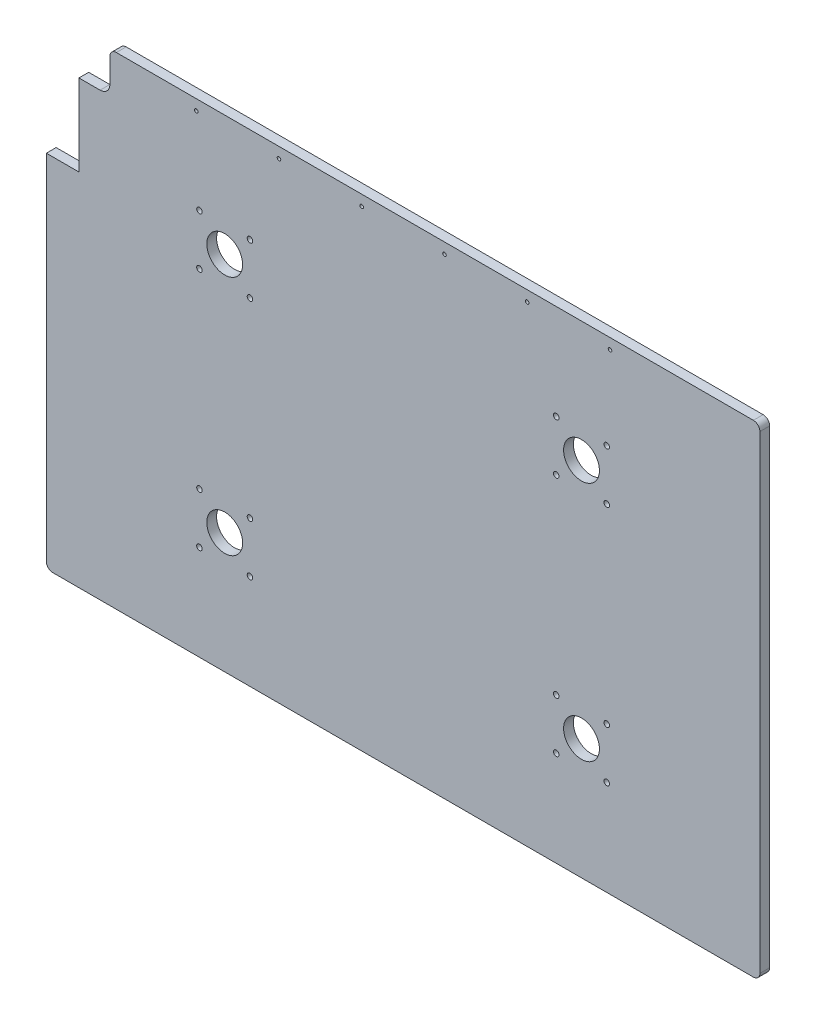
from build123d import *

# Parameters (mm, degrees)
SKETCH2_W                     = 438
SKETCH2_H                     = 296
BOSS_EXTRUDE1_DEPTH           = 6
SKETCH3_R                     = 11
SKETCH3_R_2                   = 1.7
FIRST_MOTOR_MOUNT_DEPTH       = 267.933044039
SKETCH4_R                     = 1.1
HINGE_SCREW_PILOT_HOLES_DEPTH = 267.933044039
CABLE_AND_WIRE_NOTCH_REACH    = 268.933
FILLET1_R                     = 4
HINGE_CLEARANCE_CUT_REACH     = 268.933
SKETCH6_W                     = 20
SKETCH6_H                     = 75


with BuildPart() as part:
    # Sketch2 → Boss-Extrude1 (new body)
    with BuildSketch(Plane.XY.offset(66)):
        with Locations((0, -4.5)):
            Rectangle(SKETCH2_W, SKETCH2_H)
    extrude(amount=BOSS_EXTRUDE1_DEPTH)

    # Sketch3 → first motor mount (cut, through all)
    with BuildSketch(Plane.XY.offset(72)):
        with Locations((-109.5, -78.5)):
            Circle(SKETCH3_R)
        with Locations((-125, -94)):
            Circle(SKETCH3_R_2)
        with Locations((-94, -94)):
            Circle(SKETCH3_R_2)
        with Locations((-125, -63)):
            Circle(SKETCH3_R_2)
        with Locations((-94, -63)):
            Circle(SKETCH3_R_2)
    first_motor_mount = extrude(amount=-FIRST_MOTOR_MOUNT_DEPTH, mode=Mode.SUBTRACT)

    # motor pattern: first motor mount at 3 more places
    with Locations((219, 0, 0), (219, 148, 0), (0, 148, 0)):
        add(first_motor_mount, mode=Mode.SUBTRACT)

    # Sketch4 → hinge screw pilot holes (cut, through all)
    with BuildSketch(Plane(origin=(0, 0, 66), x_dir=(-1, 0, 0), z_dir=(0, 0, -1))):
        with Locations((127, 136.97474)):
            Circle(SKETCH4_R)
        with Locations((76.2, 136.97474)):
            Circle(SKETCH4_R)
        with Locations((25.4, 136.97474)):
            Circle(SKETCH4_R)
        with Locations((-25.4, 136.97474)):
            Circle(SKETCH4_R)
        with Locations((-76.2, 136.97474)):
            Circle(SKETCH4_R)
        with Locations((-127, 136.97474)):
            Circle(SKETCH4_R)
    extrude(amount=-HINGE_SCREW_PILOT_HOLES_DEPTH, mode=Mode.SUBTRACT)

    # Sketch5 → cable and wire notch (cut, up to next)
    with BuildSketch(Plane.XY.offset(72), mode=Mode.PRIVATE) as cable_and_wire_notch_sk1:
        with BuildLine():
            Line((-180, 143.5), (-205, 143.5))
            Line((-205, 143.5), (-205, 124.5))
            ThreePointArc((-205, 124.5), (-203.242640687, 120.257359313), (-199, 118.5))
            Line((-199, 118.5), (-186, 118.5))
            ThreePointArc((-186, 118.5), (-181.757359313, 120.257359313), (-180, 124.5))
            Line((-180, 124.5), (-180, 143.5))
        make_face()
    cable_and_wire_notch_tool1 = extrude(cable_and_wire_notch_sk1.sketch, amount=-CABLE_AND_WIRE_NOTCH_REACH, mode=Mode.PRIVATE) & part.part
    add(cable_and_wire_notch_tool1.solids().sort_by_distance((-192.5, 131.282887, 72))[0], mode=Mode.SUBTRACT)

    # Fillet1
    fillet1_edges = [part.edges().sort_by_distance(p)[0] for p in [
        (-180, 143.5, 69),
        (-205, 143.5, 69),
        (-219, 143.5, 69),
        (219, 143.5, 69),
        (219, -152.5, 69),
        (-219, -152.5, 69),
    ]]
    fillet(fillet1_edges, radius=FILLET1_R)

    # Sketch6 → hinge clearance cut (cut, up to next)
    with BuildSketch(Plane.XY.offset(72), mode=Mode.PRIVATE) as hinge_clearance_cut_sk1:
        with Locations((-209, 106)):
            Rectangle(SKETCH6_W, SKETCH6_H)
    hinge_clearance_cut_tool1 = extrude(hinge_clearance_cut_sk1.sketch, amount=-HINGE_CLEARANCE_CUT_REACH, mode=Mode.PRIVATE) & part.part
    add(hinge_clearance_cut_tool1.solids().sort_by_distance((-209, 106, 72))[0], mode=Mode.SUBTRACT)


solid = part.part
